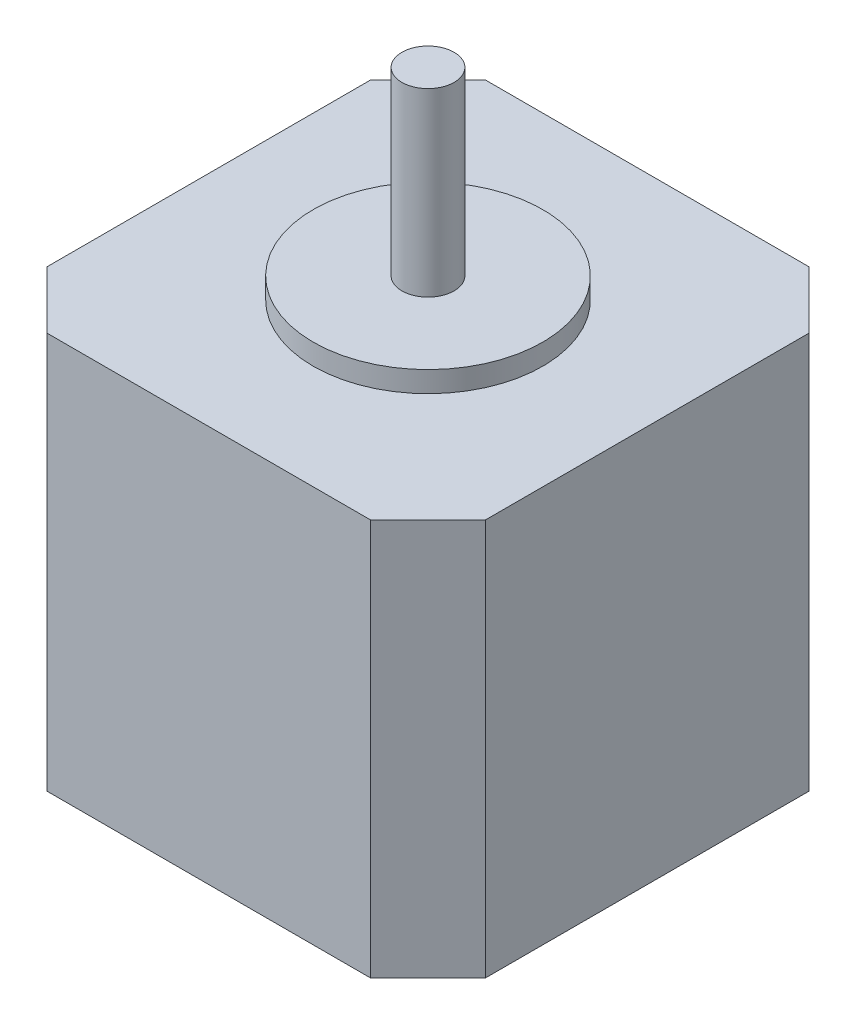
ISO-10303-21;
HEADER;
FILE_DESCRIPTION(('STEP AP214'),'2;1');
FILE_NAME('part.step','',(''),(''),'','','');
FILE_SCHEMA(('AUTOMOTIVE_DESIGN { 1 0 10303 214 1 1 1 1 }'));
ENDSEC;
DATA;
#1=APPLICATION_CONTEXT('core data for automotive mechanical design processes');
#2=APPLICATION_PROTOCOL_DEFINITION('international standard','automotive_design',2000,#1);
#3=PRODUCT_CONTEXT('',#1,'mechanical');
#4=PRODUCT('Part','Part','',(#3));
#5=PRODUCT_RELATED_PRODUCT_CATEGORY('part','',(#4));
#6=PRODUCT_DEFINITION_FORMATION('','',#4);
#7=PRODUCT_DEFINITION_CONTEXT('part definition',#1,'design');
#8=PRODUCT_DEFINITION('design','',#6,#7);
#9=PRODUCT_DEFINITION_SHAPE('','',#8);
#10=(LENGTH_UNIT() NAMED_UNIT(*) SI_UNIT(.MILLI.,.METRE.));
#11=(NAMED_UNIT(*) PLANE_ANGLE_UNIT() SI_UNIT($,.RADIAN.));
#12=(NAMED_UNIT(*) SI_UNIT($,.STERADIAN.) SOLID_ANGLE_UNIT());
#13=UNCERTAINTY_MEASURE_WITH_UNIT(LENGTH_MEASURE(1.E-05),#10,'distance_accuracy_value','');
#14=(GEOMETRIC_REPRESENTATION_CONTEXT(3) GLOBAL_UNCERTAINTY_ASSIGNED_CONTEXT((#13)) GLOBAL_UNIT_ASSIGNED_CONTEXT((#10,
#11,#12)) REPRESENTATION_CONTEXT('',''));
#15=CARTESIAN_POINT('',(0.,0.,0.));
#16=DIRECTION('',(0.,0.,1.));
#17=DIRECTION('',(1.,0.,0.));
#18=AXIS2_PLACEMENT_3D('',#15,#16,#17);
#19=CARTESIAN_POINT('',(-1.56462189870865E-07,57.3,0.));
#20=DIRECTION('',(0.,1.,0.));
#21=DIRECTION('',(0.,0.,1.));
#22=AXIS2_PLACEMENT_3D('',#19,#20,#21);
#23=PLANE('',#22);
#24=CARTESIAN_POINT('',(0.,57.3,0.));
#25=DIRECTION('',(0.,1.,0.));
#26=DIRECTION('',(0.,0.,1.));
#27=AXIS2_PLACEMENT_3D('',#24,#25,#26);
#28=CIRCLE('',#27,2.5);
#29=CARTESIAN_POINT('',(0.,57.3,2.5));
#30=VERTEX_POINT('',#29);
#31=EDGE_CURVE('E53',#30,#30,#28,.F.);
#32=ORIENTED_EDGE('',*,*,#31,.F.);
#33=EDGE_LOOP('',(#32));
#34=FACE_BOUND('',#33,.T.);
#35=ADVANCED_FACE('F50',(#34),#23,.T.);
#36=CARTESIAN_POINT('',(0.,38.,0.));
#37=DIRECTION('',(0.,1.,0.));
#38=DIRECTION('',(0.,0.,1.));
#39=AXIS2_PLACEMENT_3D('',#36,#37,#38);
#40=CYLINDRICAL_SURFACE('',#39,2.5);
#41=CARTESIAN_POINT('',(0.,40.,0.));
#42=DIRECTION('',(0.,1.,0.));
#43=DIRECTION('',(0.,0.,1.));
#44=AXIS2_PLACEMENT_3D('',#41,#42,#43);
#45=CIRCLE('',#44,2.5);
#46=CARTESIAN_POINT('',(0.,40.,2.5));
#47=VERTEX_POINT('',#46);
#48=EDGE_CURVE('E227',#47,#47,#45,.F.);
#49=ORIENTED_EDGE('',*,*,#48,.F.);
#50=EDGE_LOOP('',(#49));
#51=FACE_BOUND('',#50,.T.);
#52=ORIENTED_EDGE('',*,*,#31,.T.);
#53=EDGE_LOOP('',(#52));
#54=FACE_BOUND('',#53,.T.);
#55=ADVANCED_FACE('F234',(#51,#54),#40,.T.);
#56=CARTESIAN_POINT('',(0.,40.,0.));
#57=DIRECTION('',(0.,1.,0.));
#58=DIRECTION('',(0.,0.,1.));
#59=AXIS2_PLACEMENT_3D('',#56,#57,#58);
#60=PLANE('',#59);
#61=ORIENTED_EDGE('',*,*,#48,.T.);
#62=EDGE_LOOP('',(#61));
#63=FACE_BOUND('',#62,.T.);
#64=CARTESIAN_POINT('',(0.,40.,0.));
#65=DIRECTION('',(0.,1.,0.));
#66=DIRECTION('',(0.,0.,1.));
#67=AXIS2_PLACEMENT_3D('',#64,#65,#66);
#68=CIRCLE('',#67,11.);
#69=CARTESIAN_POINT('',(0.,40.,11.));
#70=VERTEX_POINT('',#69);
#71=EDGE_CURVE('E225',#70,#70,#68,.F.);
#72=ORIENTED_EDGE('',*,*,#71,.F.);
#73=EDGE_LOOP('',(#72));
#74=FACE_BOUND('',#73,.T.);
#75=ADVANCED_FACE('F241',(#63,#74),#60,.T.);
#76=CARTESIAN_POINT('',(0.,38.,0.));
#77=DIRECTION('',(0.,1.,0.));
#78=DIRECTION('',(0.,0.,1.));
#79=AXIS2_PLACEMENT_3D('',#76,#77,#78);
#80=CYLINDRICAL_SURFACE('',#79,11.);
#81=CARTESIAN_POINT('',(0.,38.,0.));
#82=DIRECTION('',(0.,1.,0.));
#83=DIRECTION('',(0.,0.,1.));
#84=AXIS2_PLACEMENT_3D('',#81,#82,#83);
#85=CIRCLE('',#84,11.);
#86=CARTESIAN_POINT('',(0.,38.,11.));
#87=VERTEX_POINT('',#86);
#88=EDGE_CURVE('E219',#87,#87,#85,.F.);
#89=ORIENTED_EDGE('',*,*,#88,.F.);
#90=EDGE_LOOP('',(#89));
#91=FACE_BOUND('',#90,.T.);
#92=ORIENTED_EDGE('',*,*,#71,.T.);
#93=EDGE_LOOP('',(#92));
#94=FACE_BOUND('',#93,.T.);
#95=ADVANCED_FACE('F296',(#91,#94),#80,.T.);
#96=CARTESIAN_POINT('',(-1.56462189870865E-07,38.,0.));
#97=DIRECTION('',(0.,1.,0.));
#98=DIRECTION('',(0.,0.,1.));
#99=AXIS2_PLACEMENT_3D('',#96,#97,#98);
#100=PLANE('',#99);
#101=ORIENTED_EDGE('',*,*,#88,.T.);
#102=EDGE_LOOP('',(#101));
#103=FACE_BOUND('',#102,.T.);
#104=DIRECTION('',(0.,0.,-1.));
#105=VECTOR('',#104,1.);
#106=CARTESIAN_POINT('',(21.,38.,15.5));
#107=LINE('',#106,#105);
#108=CARTESIAN_POINT('',(21.,38.,-15.5));
#109=VERTEX_POINT('',#108);
#110=CARTESIAN_POINT('',(21.,38.,15.5));
#111=VERTEX_POINT('',#110);
#112=EDGE_CURVE('E202',#109,#111,#107,.F.);
#113=ORIENTED_EDGE('',*,*,#112,.F.);
#114=DIRECTION('',(-0.707106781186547,0.,-0.707106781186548));
#115=VECTOR('',#114,1.);
#116=CARTESIAN_POINT('',(21.,38.,-15.5));
#117=LINE('',#116,#115);
#118=CARTESIAN_POINT('',(15.5,38.,-21.));
#119=VERTEX_POINT('',#118);
#120=EDGE_CURVE('E198',#119,#109,#117,.F.);
#121=ORIENTED_EDGE('',*,*,#120,.F.);
#122=DIRECTION('',(-1.,0.,0.));
#123=VECTOR('',#122,1.);
#124=CARTESIAN_POINT('',(15.5,38.,-21.));
#125=LINE('',#124,#123);
#126=CARTESIAN_POINT('',(-15.5,38.,-21.));
#127=VERTEX_POINT('',#126);
#128=EDGE_CURVE('E191',#127,#119,#125,.F.);
#129=ORIENTED_EDGE('',*,*,#128,.F.);
#130=DIRECTION('',(-0.707106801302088,0.,0.707106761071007));
#131=VECTOR('',#130,1.);
#132=CARTESIAN_POINT('',(-15.5,38.,-21.));
#133=LINE('',#132,#131);
#134=CARTESIAN_POINT('',(-21.0000002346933,38.,-15.5));
#135=VERTEX_POINT('',#134);
#136=EDGE_CURVE('E218',#135,#127,#133,.F.);
#137=ORIENTED_EDGE('',*,*,#136,.F.);
#138=DIRECTION('',(0.,0.,1.));
#139=VECTOR('',#138,1.);
#140=CARTESIAN_POINT('',(-21.,38.,-15.5));
#141=LINE('',#140,#139);
#142=CARTESIAN_POINT('',(-21.0000001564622,38.,15.4999998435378));
#143=VERTEX_POINT('',#142);
#144=EDGE_CURVE('E120',#143,#135,#141,.F.);
#145=ORIENTED_EDGE('',*,*,#144,.F.);
#146=DIRECTION('',(0.707106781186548,0.,0.707106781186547));
#147=VECTOR('',#146,1.);
#148=CARTESIAN_POINT('',(-21.,38.,15.5));
#149=LINE('',#148,#147);
#150=CARTESIAN_POINT('',(-15.5,38.,21.));
#151=VERTEX_POINT('',#150);
#152=EDGE_CURVE('E115',#151,#143,#149,.F.);
#153=ORIENTED_EDGE('',*,*,#152,.F.);
#154=DIRECTION('',(1.,0.,0.));
#155=VECTOR('',#154,1.);
#156=CARTESIAN_POINT('',(-15.5,38.,21.));
#157=LINE('',#156,#155);
#158=CARTESIAN_POINT('',(15.5,38.,21.));
#159=VERTEX_POINT('',#158);
#160=EDGE_CURVE('E210',#159,#151,#157,.F.);
#161=ORIENTED_EDGE('',*,*,#160,.F.);
#162=DIRECTION('',(0.707106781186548,0.,-0.707106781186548));
#163=VECTOR('',#162,1.);
#164=CARTESIAN_POINT('',(15.5,38.,21.));
#165=LINE('',#164,#163);
#166=EDGE_CURVE('E206',#111,#159,#165,.F.);
#167=ORIENTED_EDGE('',*,*,#166,.F.);
#168=EDGE_LOOP('',(#113,#121,#129,#137,#145,#153,#161,#167));
#169=FACE_BOUND('',#168,.T.);
#170=ADVANCED_FACE('F292',(#103,#169),#100,.T.);
#171=CARTESIAN_POINT('',(0.,-10.3,0.));
#172=DIRECTION('',(0.,-1.,0.));
#173=DIRECTION('',(0.,0.,-1.));
#174=AXIS2_PLACEMENT_3D('',#171,#172,#173);
#175=PLANE('',#174);
#176=CARTESIAN_POINT('',(0.,-10.3,0.));
#177=DIRECTION('',(0.,-1.,0.));
#178=DIRECTION('',(0.,0.,-1.));
#179=AXIS2_PLACEMENT_3D('',#176,#177,#178);
#180=CIRCLE('',#179,2.5);
#181=CARTESIAN_POINT('',(0.,-10.3,-2.5));
#182=VERTEX_POINT('',#181);
#183=EDGE_CURVE('E189',#182,#182,#180,.F.);
#184=ORIENTED_EDGE('',*,*,#183,.F.);
#185=EDGE_LOOP('',(#184));
#186=FACE_BOUND('',#185,.T.);
#187=ADVANCED_FACE('F288',(#186),#175,.T.);
#188=CARTESIAN_POINT('',(-15.5,0.,-21.));
#189=DIRECTION('',(-0.707106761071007,0.,-0.707106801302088));
#190=DIRECTION('',(-0.707106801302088,0.,0.707106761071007));
#191=AXIS2_PLACEMENT_3D('',#188,#189,#190);
#192=PLANE('',#191);
#193=ORIENTED_EDGE('',*,*,#136,.T.);
#194=DIRECTION('',(0.,1.,0.));
#195=VECTOR('',#194,1.);
#196=CARTESIAN_POINT('',(-15.5,0.,-21.));
#197=LINE('',#196,#195);
#198=CARTESIAN_POINT('',(-15.5,0.,-21.));
#199=VERTEX_POINT('',#198);
#200=EDGE_CURVE('E193',#199,#127,#197,.T.);
#201=ORIENTED_EDGE('',*,*,#200,.F.);
#202=DIRECTION('',(-0.707106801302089,0.,0.707106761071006));
#203=VECTOR('',#202,1.);
#204=CARTESIAN_POINT('',(-15.5,0.,-21.));
#205=LINE('',#204,#203);
#206=CARTESIAN_POINT('',(-21.0000002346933,0.,-15.5));
#207=VERTEX_POINT('',#206);
#208=EDGE_CURVE('E186',#199,#207,#205,.T.);
#209=ORIENTED_EDGE('',*,*,#208,.T.);
#210=DIRECTION('',(0.,1.,0.));
#211=VECTOR('',#210,1.);
#212=CARTESIAN_POINT('',(-21.,0.,-15.5));
#213=LINE('',#212,#211);
#214=EDGE_CURVE('E215',#135,#207,#213,.F.);
#215=ORIENTED_EDGE('',*,*,#214,.F.);
#216=EDGE_LOOP('',(#193,#201,#209,#215));
#217=FACE_BOUND('',#216,.T.);
#218=ADVANCED_FACE('F285',(#217),#192,.T.);
#219=CARTESIAN_POINT('',(-21.,0.,-15.5));
#220=DIRECTION('',(-1.,0.,0.));
#221=DIRECTION('',(0.,0.,1.));
#222=AXIS2_PLACEMENT_3D('',#219,#220,#221);
#223=PLANE('',#222);
#224=ORIENTED_EDGE('',*,*,#144,.T.);
#225=ORIENTED_EDGE('',*,*,#214,.T.);
#226=DIRECTION('',(0.,0.,1.));
#227=VECTOR('',#226,1.);
#228=CARTESIAN_POINT('',(-21.0000003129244,0.,0.));
#229=LINE('',#228,#227);
#230=CARTESIAN_POINT('',(-21.0000000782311,0.,15.4999999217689));
#231=VERTEX_POINT('',#230);
#232=EDGE_CURVE('E183',#207,#231,#229,.T.);
#233=ORIENTED_EDGE('',*,*,#232,.T.);
#234=DIRECTION('',(0.,1.,0.));
#235=VECTOR('',#234,1.);
#236=CARTESIAN_POINT('',(-21.,0.,15.5));
#237=LINE('',#236,#235);
#238=EDGE_CURVE('E212',#143,#231,#237,.F.);
#239=ORIENTED_EDGE('',*,*,#238,.F.);
#240=EDGE_LOOP('',(#224,#225,#233,#239));
#241=FACE_BOUND('',#240,.T.);
#242=ADVANCED_FACE('F282',(#241),#223,.T.);
#243=CARTESIAN_POINT('',(-21.,0.,15.5));
#244=DIRECTION('',(-0.707106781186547,0.,0.707106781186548));
#245=DIRECTION('',(0.707106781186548,0.,0.707106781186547));
#246=AXIS2_PLACEMENT_3D('',#243,#244,#245);
#247=PLANE('',#246);
#248=ORIENTED_EDGE('',*,*,#152,.T.);
#249=ORIENTED_EDGE('',*,*,#238,.T.);
#250=DIRECTION('',(0.707106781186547,0.,0.707106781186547));
#251=VECTOR('',#250,1.);
#252=CARTESIAN_POINT('',(-21.,0.,15.5));
#253=LINE('',#252,#251);
#254=CARTESIAN_POINT('',(-15.5,0.,21.));
#255=VERTEX_POINT('',#254);
#256=EDGE_CURVE('E180',#231,#255,#253,.T.);
#257=ORIENTED_EDGE('',*,*,#256,.T.);
#258=DIRECTION('',(0.,1.,0.));
#259=VECTOR('',#258,1.);
#260=CARTESIAN_POINT('',(-15.5,0.,21.));
#261=LINE('',#260,#259);
#262=EDGE_CURVE('E208',#151,#255,#261,.F.);
#263=ORIENTED_EDGE('',*,*,#262,.F.);
#264=EDGE_LOOP('',(#248,#249,#257,#263));
#265=FACE_BOUND('',#264,.T.);
#266=ADVANCED_FACE('F278',(#265),#247,.T.);
#267=CARTESIAN_POINT('',(-15.5,0.,21.));
#268=DIRECTION('',(0.,0.,1.));
#269=DIRECTION('',(1.,0.,0.));
#270=AXIS2_PLACEMENT_3D('',#267,#268,#269);
#271=PLANE('',#270);
#272=ORIENTED_EDGE('',*,*,#160,.T.);
#273=ORIENTED_EDGE('',*,*,#262,.T.);
#274=DIRECTION('',(1.,0.,0.));
#275=VECTOR('',#274,1.);
#276=CARTESIAN_POINT('',(-1.56462189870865E-07,0.,21.));
#277=LINE('',#276,#275);
#278=CARTESIAN_POINT('',(15.5,0.,21.));
#279=VERTEX_POINT('',#278);
#280=EDGE_CURVE('E177',#255,#279,#277,.T.);
#281=ORIENTED_EDGE('',*,*,#280,.T.);
#282=DIRECTION('',(0.,1.,0.));
#283=VECTOR('',#282,1.);
#284=CARTESIAN_POINT('',(15.5,0.,21.));
#285=LINE('',#284,#283);
#286=EDGE_CURVE('E204',#159,#279,#285,.F.);
#287=ORIENTED_EDGE('',*,*,#286,.F.);
#288=EDGE_LOOP('',(#272,#273,#281,#287));
#289=FACE_BOUND('',#288,.T.);
#290=ADVANCED_FACE('F274',(#289),#271,.T.);
#291=CARTESIAN_POINT('',(15.5,0.,21.));
#292=DIRECTION('',(0.707106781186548,0.,0.707106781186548));
#293=DIRECTION('',(0.707106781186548,0.,-0.707106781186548));
#294=AXIS2_PLACEMENT_3D('',#291,#292,#293);
#295=PLANE('',#294);
#296=ORIENTED_EDGE('',*,*,#166,.T.);
#297=ORIENTED_EDGE('',*,*,#286,.T.);
#298=DIRECTION('',(0.707106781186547,0.,-0.707106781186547));
#299=VECTOR('',#298,1.);
#300=CARTESIAN_POINT('',(15.5,0.,21.));
#301=LINE('',#300,#299);
#302=CARTESIAN_POINT('',(21.,0.,15.5));
#303=VERTEX_POINT('',#302);
#304=EDGE_CURVE('E174',#279,#303,#301,.T.);
#305=ORIENTED_EDGE('',*,*,#304,.T.);
#306=DIRECTION('',(0.,1.,0.));
#307=VECTOR('',#306,1.);
#308=CARTESIAN_POINT('',(21.,0.,15.5));
#309=LINE('',#308,#307);
#310=EDGE_CURVE('E200',#111,#303,#309,.F.);
#311=ORIENTED_EDGE('',*,*,#310,.F.);
#312=EDGE_LOOP('',(#296,#297,#305,#311));
#313=FACE_BOUND('',#312,.T.);
#314=ADVANCED_FACE('F270',(#313),#295,.T.);
#315=CARTESIAN_POINT('',(21.,0.,15.5));
#316=DIRECTION('',(1.,0.,0.));
#317=DIRECTION('',(0.,0.,-1.));
#318=AXIS2_PLACEMENT_3D('',#315,#316,#317);
#319=PLANE('',#318);
#320=ORIENTED_EDGE('',*,*,#112,.T.);
#321=ORIENTED_EDGE('',*,*,#310,.T.);
#322=DIRECTION('',(0.,0.,1.));
#323=VECTOR('',#322,1.);
#324=CARTESIAN_POINT('',(21.,0.,0.));
#325=LINE('',#324,#323);
#326=CARTESIAN_POINT('',(21.,0.,-15.5));
#327=VERTEX_POINT('',#326);
#328=EDGE_CURVE('E171',#303,#327,#325,.F.);
#329=ORIENTED_EDGE('',*,*,#328,.T.);
#330=DIRECTION('',(0.,1.,0.));
#331=VECTOR('',#330,1.);
#332=CARTESIAN_POINT('',(21.,0.,-15.5));
#333=LINE('',#332,#331);
#334=EDGE_CURVE('E196',#109,#327,#333,.F.);
#335=ORIENTED_EDGE('',*,*,#334,.F.);
#336=EDGE_LOOP('',(#320,#321,#329,#335));
#337=FACE_BOUND('',#336,.T.);
#338=ADVANCED_FACE('F266',(#337),#319,.T.);
#339=CARTESIAN_POINT('',(21.,0.,-15.5));
#340=DIRECTION('',(0.707106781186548,0.,-0.707106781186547));
#341=DIRECTION('',(-0.707106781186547,0.,-0.707106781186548));
#342=AXIS2_PLACEMENT_3D('',#339,#340,#341);
#343=PLANE('',#342);
#344=ORIENTED_EDGE('',*,*,#120,.T.);
#345=ORIENTED_EDGE('',*,*,#334,.T.);
#346=DIRECTION('',(-0.707106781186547,0.,-0.707106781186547));
#347=VECTOR('',#346,1.);
#348=CARTESIAN_POINT('',(21.,0.,-15.5));
#349=LINE('',#348,#347);
#350=CARTESIAN_POINT('',(15.5,0.,-21.));
#351=VERTEX_POINT('',#350);
#352=EDGE_CURVE('E168',#327,#351,#349,.T.);
#353=ORIENTED_EDGE('',*,*,#352,.T.);
#354=DIRECTION('',(0.,1.,0.));
#355=VECTOR('',#354,1.);
#356=CARTESIAN_POINT('',(15.5,0.,-21.));
#357=LINE('',#356,#355);
#358=EDGE_CURVE('E68',#119,#351,#357,.F.);
#359=ORIENTED_EDGE('',*,*,#358,.F.);
#360=EDGE_LOOP('',(#344,#345,#353,#359));
#361=FACE_BOUND('',#360,.T.);
#362=ADVANCED_FACE('F263',(#361),#343,.T.);
#363=CARTESIAN_POINT('',(15.5,0.,-21.));
#364=DIRECTION('',(0.,0.,-1.));
#365=DIRECTION('',(-1.,0.,0.));
#366=AXIS2_PLACEMENT_3D('',#363,#364,#365);
#367=PLANE('',#366);
#368=ORIENTED_EDGE('',*,*,#128,.T.);
#369=ORIENTED_EDGE('',*,*,#358,.T.);
#370=DIRECTION('',(1.,0.,0.));
#371=VECTOR('',#370,1.);
#372=CARTESIAN_POINT('',(-1.56462189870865E-07,0.,-21.));
#373=LINE('',#372,#371);
#374=EDGE_CURVE('E59',#351,#199,#373,.F.);
#375=ORIENTED_EDGE('',*,*,#374,.T.);
#376=ORIENTED_EDGE('',*,*,#200,.T.);
#377=EDGE_LOOP('',(#368,#369,#375,#376));
#378=FACE_BOUND('',#377,.T.);
#379=ADVANCED_FACE('F254',(#378),#367,.T.);
#380=CARTESIAN_POINT('',(0.,0.,0.));
#381=DIRECTION('',(0.,-1.,0.));
#382=DIRECTION('',(0.,0.,-1.));
#383=AXIS2_PLACEMENT_3D('',#380,#381,#382);
#384=CYLINDRICAL_SURFACE('',#383,2.5);
#385=CARTESIAN_POINT('',(0.,0.,0.));
#386=DIRECTION('',(0.,-1.,0.));
#387=DIRECTION('',(0.,0.,-1.));
#388=AXIS2_PLACEMENT_3D('',#385,#386,#387);
#389=CIRCLE('',#388,2.5);
#390=CARTESIAN_POINT('',(0.,0.,-2.5));
#391=VERTEX_POINT('',#390);
#392=EDGE_CURVE('E13',#391,#391,#389,.T.);
#393=ORIENTED_EDGE('',*,*,#392,.T.);
#394=EDGE_LOOP('',(#393));
#395=FACE_BOUND('',#394,.T.);
#396=ORIENTED_EDGE('',*,*,#183,.T.);
#397=EDGE_LOOP('',(#396));
#398=FACE_BOUND('',#397,.T.);
#399=ADVANCED_FACE('F248',(#395,#398),#384,.T.);
#400=CARTESIAN_POINT('',(-1.56462189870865E-07,0.,0.));
#401=DIRECTION('',(0.,1.,0.));
#402=DIRECTION('',(0.,0.,1.));
#403=AXIS2_PLACEMENT_3D('',#400,#401,#402);
#404=PLANE('',#403);
#405=CARTESIAN_POINT('',(-15.494,0.,15.494));
#406=DIRECTION('',(0.,-1.,0.));
#407=DIRECTION('',(0.,0.,-1.));
#408=AXIS2_PLACEMENT_3D('',#405,#406,#407);
#409=CIRCLE('',#408,1.24999999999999);
#410=CARTESIAN_POINT('',(-15.494,0.,14.244));
#411=VERTEX_POINT('',#410);
#412=EDGE_CURVE('E145',#411,#411,#409,.T.);
#413=ORIENTED_EDGE('',*,*,#412,.F.);
#414=EDGE_LOOP('',(#413));
#415=FACE_BOUND('',#414,.T.);
#416=CARTESIAN_POINT('',(15.494,0.,15.494));
#417=DIRECTION('',(0.,-1.,0.));
#418=DIRECTION('',(0.,0.,-1.));
#419=AXIS2_PLACEMENT_3D('',#416,#417,#418);
#420=CIRCLE('',#419,1.24999999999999);
#421=CARTESIAN_POINT('',(15.494,0.,14.244));
#422=VERTEX_POINT('',#421);
#423=EDGE_CURVE('E144',#422,#422,#420,.T.);
#424=ORIENTED_EDGE('',*,*,#423,.F.);
#425=EDGE_LOOP('',(#424));
#426=FACE_BOUND('',#425,.T.);
#427=CARTESIAN_POINT('',(-15.494,0.,-15.494));
#428=DIRECTION('',(0.,-1.,0.));
#429=DIRECTION('',(0.,0.,-1.));
#430=AXIS2_PLACEMENT_3D('',#427,#428,#429);
#431=CIRCLE('',#430,1.24999999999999);
#432=CARTESIAN_POINT('',(-15.494,0.,-16.744));
#433=VERTEX_POINT('',#432);
#434=EDGE_CURVE('E155',#433,#433,#431,.T.);
#435=ORIENTED_EDGE('',*,*,#434,.F.);
#436=EDGE_LOOP('',(#435));
#437=FACE_BOUND('',#436,.T.);
#438=CARTESIAN_POINT('',(15.494,0.,-15.494));
#439=DIRECTION('',(0.,-1.,0.));
#440=DIRECTION('',(0.,0.,-1.));
#441=AXIS2_PLACEMENT_3D('',#438,#439,#440);
#442=CIRCLE('',#441,1.24999999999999);
#443=CARTESIAN_POINT('',(15.494,0.,-16.744));
#444=VERTEX_POINT('',#443);
#445=EDGE_CURVE('E161',#444,#444,#442,.T.);
#446=ORIENTED_EDGE('',*,*,#445,.F.);
#447=EDGE_LOOP('',(#446));
#448=FACE_BOUND('',#447,.T.);
#449=ORIENTED_EDGE('',*,*,#392,.F.);
#450=EDGE_LOOP('',(#449));
#451=FACE_BOUND('',#450,.T.);
#452=ORIENTED_EDGE('',*,*,#352,.F.);
#453=ORIENTED_EDGE('',*,*,#328,.F.);
#454=ORIENTED_EDGE('',*,*,#304,.F.);
#455=ORIENTED_EDGE('',*,*,#280,.F.);
#456=ORIENTED_EDGE('',*,*,#256,.F.);
#457=ORIENTED_EDGE('',*,*,#232,.F.);
#458=ORIENTED_EDGE('',*,*,#208,.F.);
#459=ORIENTED_EDGE('',*,*,#374,.F.);
#460=EDGE_LOOP('',(#452,#453,#454,#455,#456,#457,#458,#459));
#461=FACE_BOUND('',#460,.T.);
#462=ADVANCED_FACE('F245',(#415,#426,#437,#448,#451,#461),#404,.F.);
#463=CARTESIAN_POINT('',(15.494,7.5,-15.494));
#464=DIRECTION('',(0.,-1.,0.));
#465=DIRECTION('',(0.,0.,-1.));
#466=AXIS2_PLACEMENT_3D('',#463,#464,#465);
#467=CONICAL_SURFACE('',#466,1.25,1.02974425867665);
#468=CARTESIAN_POINT('',(15.494,8.25107577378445,-15.494));
#469=VERTEX_POINT('',#468);
#470=VERTEX_LOOP('',#469);
#471=FACE_BOUND('',#470,.T.);
#472=CARTESIAN_POINT('',(15.494,7.5,-15.494));
#473=DIRECTION('',(0.,-1.,0.));
#474=DIRECTION('',(0.,0.,-1.));
#475=AXIS2_PLACEMENT_3D('',#472,#473,#474);
#476=CIRCLE('',#475,1.25);
#477=CARTESIAN_POINT('',(15.494,7.5,-16.744));
#478=VERTEX_POINT('',#477);
#479=EDGE_CURVE('E164',#478,#478,#476,.T.);
#480=ORIENTED_EDGE('',*,*,#479,.T.);
#481=EDGE_LOOP('',(#480));
#482=FACE_BOUND('',#481,.T.);
#483=ADVANCED_FACE('F237',(#471,#482),#467,.F.);
#484=CARTESIAN_POINT('',(15.494,0.,-15.494));
#485=DIRECTION('',(0.,-1.,0.));
#486=DIRECTION('',(0.,0.,-1.));
#487=AXIS2_PLACEMENT_3D('',#484,#485,#486);
#488=CYLINDRICAL_SURFACE('',#487,1.24999999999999);
#489=ORIENTED_EDGE('',*,*,#479,.F.);
#490=EDGE_LOOP('',(#489));
#491=FACE_BOUND('',#490,.T.);
#492=ORIENTED_EDGE('',*,*,#445,.T.);
#493=EDGE_LOOP('',(#492));
#494=FACE_BOUND('',#493,.T.);
#495=ADVANCED_FACE('F244',(#491,#494),#488,.F.);
#496=CARTESIAN_POINT('',(-15.494,7.5,-15.494));
#497=DIRECTION('',(0.,-1.,0.));
#498=DIRECTION('',(0.,0.,-1.));
#499=AXIS2_PLACEMENT_3D('',#496,#497,#498);
#500=CONICAL_SURFACE('',#499,1.25,1.02974425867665);
#501=CARTESIAN_POINT('',(-15.494,8.25107577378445,-15.494));
#502=VERTEX_POINT('',#501);
#503=VERTEX_LOOP('',#502);
#504=FACE_BOUND('',#503,.T.);
#505=CARTESIAN_POINT('',(-15.494,7.5,-15.494));
#506=DIRECTION('',(0.,-1.,0.));
#507=DIRECTION('',(0.,0.,-1.));
#508=AXIS2_PLACEMENT_3D('',#505,#506,#507);
#509=CIRCLE('',#508,1.25);
#510=CARTESIAN_POINT('',(-15.494,7.5,-16.744));
#511=VERTEX_POINT('',#510);
#512=EDGE_CURVE('E158',#511,#511,#509,.T.);
#513=ORIENTED_EDGE('',*,*,#512,.T.);
#514=EDGE_LOOP('',(#513));
#515=FACE_BOUND('',#514,.T.);
#516=ADVANCED_FACE('F398',(#504,#515),#500,.F.);
#517=CARTESIAN_POINT('',(-15.494,0.,-15.494));
#518=DIRECTION('',(0.,-1.,0.));
#519=DIRECTION('',(0.,0.,-1.));
#520=AXIS2_PLACEMENT_3D('',#517,#518,#519);
#521=CYLINDRICAL_SURFACE('',#520,1.24999999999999);
#522=ORIENTED_EDGE('',*,*,#512,.F.);
#523=EDGE_LOOP('',(#522));
#524=FACE_BOUND('',#523,.T.);
#525=ORIENTED_EDGE('',*,*,#434,.T.);
#526=EDGE_LOOP('',(#525));
#527=FACE_BOUND('',#526,.T.);
#528=ADVANCED_FACE('F409',(#524,#527),#521,.F.);
#529=CARTESIAN_POINT('',(15.494,7.5,15.494));
#530=DIRECTION('',(0.,-1.,0.));
#531=DIRECTION('',(0.,0.,-1.));
#532=AXIS2_PLACEMENT_3D('',#529,#530,#531);
#533=CONICAL_SURFACE('',#532,1.25,1.02974425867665);
#534=CARTESIAN_POINT('',(15.494,8.25107577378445,15.494));
#535=VERTEX_POINT('',#534);
#536=VERTEX_LOOP('',#535);
#537=FACE_BOUND('',#536,.T.);
#538=CARTESIAN_POINT('',(15.494,7.5,15.494));
#539=DIRECTION('',(0.,-1.,0.));
#540=DIRECTION('',(0.,0.,-1.));
#541=AXIS2_PLACEMENT_3D('',#538,#539,#540);
#542=CIRCLE('',#541,1.25);
#543=CARTESIAN_POINT('',(15.494,7.5,14.244));
#544=VERTEX_POINT('',#543);
#545=EDGE_CURVE('E148',#544,#544,#542,.T.);
#546=ORIENTED_EDGE('',*,*,#545,.T.);
#547=EDGE_LOOP('',(#546));
#548=FACE_BOUND('',#547,.T.);
#549=ADVANCED_FACE('F418',(#537,#548),#533,.F.);
#550=CARTESIAN_POINT('',(15.494,0.,15.494));
#551=DIRECTION('',(0.,-1.,0.));
#552=DIRECTION('',(0.,0.,-1.));
#553=AXIS2_PLACEMENT_3D('',#550,#551,#552);
#554=CYLINDRICAL_SURFACE('',#553,1.24999999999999);
#555=ORIENTED_EDGE('',*,*,#545,.F.);
#556=EDGE_LOOP('',(#555));
#557=FACE_BOUND('',#556,.T.);
#558=ORIENTED_EDGE('',*,*,#423,.T.);
#559=EDGE_LOOP('',(#558));
#560=FACE_BOUND('',#559,.T.);
#561=ADVANCED_FACE('F138',(#557,#560),#554,.F.);
#562=CARTESIAN_POINT('',(-15.494,7.5,15.494));
#563=DIRECTION('',(0.,-1.,0.));
#564=DIRECTION('',(0.,0.,-1.));
#565=AXIS2_PLACEMENT_3D('',#562,#563,#564);
#566=CONICAL_SURFACE('',#565,1.25,1.02974425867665);
#567=CARTESIAN_POINT('',(-15.494,8.25107577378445,15.494));
#568=VERTEX_POINT('',#567);
#569=VERTEX_LOOP('',#568);
#570=FACE_BOUND('',#569,.T.);
#571=CARTESIAN_POINT('',(-15.494,7.5,15.494));
#572=DIRECTION('',(0.,-1.,0.));
#573=DIRECTION('',(0.,0.,-1.));
#574=AXIS2_PLACEMENT_3D('',#571,#572,#573);
#575=CIRCLE('',#574,1.25);
#576=CARTESIAN_POINT('',(-15.494,7.5,14.244));
#577=VERTEX_POINT('',#576);
#578=EDGE_CURVE('E142',#577,#577,#575,.T.);
#579=ORIENTED_EDGE('',*,*,#578,.T.);
#580=EDGE_LOOP('',(#579));
#581=FACE_BOUND('',#580,.T.);
#582=ADVANCED_FACE('F134',(#570,#581),#566,.F.);
#583=CARTESIAN_POINT('',(-15.494,0.,15.494));
#584=DIRECTION('',(0.,-1.,0.));
#585=DIRECTION('',(0.,0.,-1.));
#586=AXIS2_PLACEMENT_3D('',#583,#584,#585);
#587=CYLINDRICAL_SURFACE('',#586,1.24999999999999);
#588=ORIENTED_EDGE('',*,*,#578,.F.);
#589=EDGE_LOOP('',(#588));
#590=FACE_BOUND('',#589,.T.);
#591=ORIENTED_EDGE('',*,*,#412,.T.);
#592=EDGE_LOOP('',(#591));
#593=FACE_BOUND('',#592,.T.);
#594=ADVANCED_FACE('F137',(#590,#593),#587,.F.);
#595=CLOSED_SHELL('',(#35,#55,#75,#95,#170,#187,#218,#242,#266,#290,#314,#338,#362,#379,#399,
#462,#483,#495,#516,#528,#549,#561,#582,#594));
#596=MANIFOLD_SOLID_BREP('B2',#595);
#597=ADVANCED_BREP_SHAPE_REPRESENTATION('',(#18,#596),#14);
#598=SHAPE_DEFINITION_REPRESENTATION(#9,#597);
ENDSEC;
END-ISO-10303-21;
